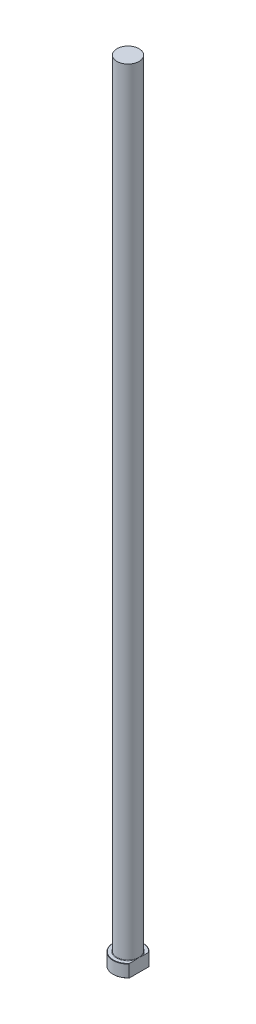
ISO-10303-21;
HEADER;
FILE_DESCRIPTION(('STEP AP214'),'2;1');
FILE_NAME('part.step','',(''),(''),'','','');
FILE_SCHEMA(('AUTOMOTIVE_DESIGN { 1 0 10303 214 1 1 1 1 }'));
ENDSEC;
DATA;
#1=APPLICATION_CONTEXT('core data for automotive mechanical design processes');
#2=APPLICATION_PROTOCOL_DEFINITION('international standard','automotive_design',2000,#1);
#3=PRODUCT_CONTEXT('',#1,'mechanical');
#4=PRODUCT('Part','Part','',(#3));
#5=PRODUCT_RELATED_PRODUCT_CATEGORY('part','',(#4));
#6=PRODUCT_DEFINITION_FORMATION('','',#4);
#7=PRODUCT_DEFINITION_CONTEXT('part definition',#1,'design');
#8=PRODUCT_DEFINITION('design','',#6,#7);
#9=PRODUCT_DEFINITION_SHAPE('','',#8);
#10=(LENGTH_UNIT() NAMED_UNIT(*) SI_UNIT(.MILLI.,.METRE.));
#11=(NAMED_UNIT(*) PLANE_ANGLE_UNIT() SI_UNIT($,.RADIAN.));
#12=(NAMED_UNIT(*) SI_UNIT($,.STERADIAN.) SOLID_ANGLE_UNIT());
#13=UNCERTAINTY_MEASURE_WITH_UNIT(LENGTH_MEASURE(1.E-05),#10,'distance_accuracy_value','');
#14=(GEOMETRIC_REPRESENTATION_CONTEXT(3) GLOBAL_UNCERTAINTY_ASSIGNED_CONTEXT((#13)) GLOBAL_UNIT_ASSIGNED_CONTEXT((#10,
#11,#12)) REPRESENTATION_CONTEXT('',''));
#15=CARTESIAN_POINT('',(0.,0.,0.));
#16=DIRECTION('',(0.,0.,1.));
#17=DIRECTION('',(1.,0.,0.));
#18=AXIS2_PLACEMENT_3D('',#15,#16,#17);
#19=CARTESIAN_POINT('',(0.,0.,0.));
#20=DIRECTION('',(0.,-1.,0.));
#21=DIRECTION('',(0.,0.,-1.));
#22=AXIS2_PLACEMENT_3D('',#19,#20,#21);
#23=PLANE('',#22);
#24=CARTESIAN_POINT('',(0.,0.,0.));
#25=DIRECTION('',(0.,-1.,0.));
#26=DIRECTION('',(0.,0.,-1.));
#27=AXIS2_PLACEMENT_3D('',#24,#25,#26);
#28=CIRCLE('',#27,9.29999999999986);
#29=CARTESIAN_POINT('',(6.99999999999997,0.,6.12290780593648));
#30=VERTEX_POINT('',#29);
#31=CARTESIAN_POINT('',(6.99999999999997,0.,-6.12290780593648));
#32=VERTEX_POINT('',#31);
#33=EDGE_CURVE('E98',#30,#32,#28,.T.);
#34=ORIENTED_EDGE('',*,*,#33,.T.);
#35=DIRECTION('',(0.,0.,1.));
#36=VECTOR('',#35,1.);
#37=CARTESIAN_POINT('',(6.99999999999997,0.,6.42261628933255));
#38=LINE('',#37,#36);
#39=EDGE_CURVE('E83',#32,#30,#38,.T.);
#40=ORIENTED_EDGE('',*,*,#39,.T.);
#41=EDGE_LOOP('',(#34,#40));
#42=FACE_BOUND('',#41,.T.);
#43=ADVANCED_FACE('F32',(#42),#23,.T.);
#44=CARTESIAN_POINT('',(0.,259.958771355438,0.));
#45=DIRECTION('',(0.,1.,0.));
#46=DIRECTION('',(0.,0.,1.));
#47=AXIS2_PLACEMENT_3D('',#44,#45,#46);
#48=CYLINDRICAL_SURFACE('',#47,9.49999999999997);
#49=CARTESIAN_POINT('',(0.,7.79999999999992,0.));
#50=DIRECTION('',(0.,1.,0.));
#51=DIRECTION('',(0.,0.,1.));
#52=AXIS2_PLACEMENT_3D('',#49,#50,#51);
#53=CIRCLE('',#52,9.49999999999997);
#54=CARTESIAN_POINT('',(6.99999999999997,7.79999999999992,6.42261628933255));
#55=VERTEX_POINT('',#54);
#56=CARTESIAN_POINT('',(6.99999999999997,7.79999999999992,-6.42261628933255));
#57=VERTEX_POINT('',#56);
#58=EDGE_CURVE('E104',#55,#57,#53,.F.);
#59=ORIENTED_EDGE('',*,*,#58,.T.);
#60=DIRECTION('',(0.,-1.,0.));
#61=VECTOR('',#60,1.);
#62=CARTESIAN_POINT('',(6.99999999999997,500.,-6.42261628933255));
#63=LINE('',#62,#61);
#64=CARTESIAN_POINT('',(6.99999999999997,0.200000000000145,-6.42261628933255));
#65=VERTEX_POINT('',#64);
#66=EDGE_CURVE('E183',#57,#65,#63,.T.);
#67=ORIENTED_EDGE('',*,*,#66,.T.);
#68=CARTESIAN_POINT('',(0.,0.200000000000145,0.));
#69=DIRECTION('',(0.,-1.,0.));
#70=DIRECTION('',(0.,0.,-1.));
#71=AXIS2_PLACEMENT_3D('',#68,#69,#70);
#72=CIRCLE('',#71,9.49999999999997);
#73=CARTESIAN_POINT('',(6.99999999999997,0.200000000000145,6.42261628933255));
#74=VERTEX_POINT('',#73);
#75=EDGE_CURVE('E100',#65,#74,#72,.F.);
#76=ORIENTED_EDGE('',*,*,#75,.T.);
#77=DIRECTION('',(0.,-1.,0.));
#78=VECTOR('',#77,1.);
#79=CARTESIAN_POINT('',(6.99999999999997,500.,6.42261628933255));
#80=LINE('',#79,#78);
#81=EDGE_CURVE('E93',#55,#74,#80,.T.);
#82=ORIENTED_EDGE('',*,*,#81,.F.);
#83=EDGE_LOOP('',(#59,#67,#76,#82));
#84=FACE_BOUND('',#83,.T.);
#85=ADVANCED_FACE('F158',(#84),#48,.T.);
#86=CARTESIAN_POINT('',(-9.49999999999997,8.,0.));
#87=DIRECTION('',(0.,1.,0.));
#88=DIRECTION('',(0.,0.,1.));
#89=AXIS2_PLACEMENT_3D('',#86,#87,#88);
#90=PLANE('',#89);
#91=CARTESIAN_POINT('',(0.,8.,0.));
#92=DIRECTION('',(0.,1.,0.));
#93=DIRECTION('',(0.,0.,1.));
#94=AXIS2_PLACEMENT_3D('',#91,#92,#93);
#95=CIRCLE('',#94,9.29999999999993);
#96=CARTESIAN_POINT('',(6.99999999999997,8.,-6.12290780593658));
#97=VERTEX_POINT('',#96);
#98=CARTESIAN_POINT('',(6.99999999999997,8.,6.12290780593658));
#99=VERTEX_POINT('',#98);
#100=EDGE_CURVE('E178',#97,#99,#95,.T.);
#101=ORIENTED_EDGE('',*,*,#100,.T.);
#102=DIRECTION('',(0.,0.,-1.));
#103=VECTOR('',#102,1.);
#104=CARTESIAN_POINT('',(6.99999999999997,8.,0.));
#105=LINE('',#104,#103);
#106=CARTESIAN_POINT('',(6.99999999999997,7.99999999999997,2.07123151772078));
#107=VERTEX_POINT('',#106);
#108=EDGE_CURVE('E57',#99,#107,#105,.T.);
#109=ORIENTED_EDGE('',*,*,#108,.T.);
#110=CARTESIAN_POINT('',(0.,8.,0.));
#111=DIRECTION('',(0.,1.,0.));
#112=DIRECTION('',(0.,0.,1.));
#113=AXIS2_PLACEMENT_3D('',#110,#111,#112);
#114=CIRCLE('',#113,7.29999999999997);
#115=CARTESIAN_POINT('',(6.99999999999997,7.99999999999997,-2.07123151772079));
#116=VERTEX_POINT('',#115);
#117=EDGE_CURVE('E107',#107,#116,#114,.F.);
#118=ORIENTED_EDGE('',*,*,#117,.T.);
#119=EDGE_CURVE('E136',#116,#97,#105,.T.);
#120=ORIENTED_EDGE('',*,*,#119,.T.);
#121=EDGE_LOOP('',(#101,#109,#118,#120));
#122=FACE_BOUND('',#121,.T.);
#123=ADVANCED_FACE('F147',(#122),#90,.T.);
#124=CARTESIAN_POINT('',(0.,8.00000000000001,0.));
#125=DIRECTION('',(0.,-1.,0.));
#126=DIRECTION('',(0.,0.,-1.));
#127=AXIS2_PLACEMENT_3D('',#124,#125,#126);
#128=CONICAL_SURFACE('',#127,9.29999999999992,0.785398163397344);
#129=ORIENTED_EDGE('',*,*,#58,.F.);
#130=CARTESIAN_POINT('',(6.99999999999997,1.53034396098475,14.1308899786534));
#131=CARTESIAN_POINT('',(6.99999999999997,1.71491325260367,13.9249118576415));
#132=CARTESIAN_POINT('',(6.99999999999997,1.89904603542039,13.7185428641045));
#133=CARTESIAN_POINT('',(6.99999999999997,2.26631423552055,13.3049153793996));
#134=CARTESIAN_POINT('',(6.99999999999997,2.44944964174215,13.0976568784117));
#135=CARTESIAN_POINT('',(6.99999999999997,2.99728613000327,12.4742569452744));
#136=CARTESIAN_POINT('',(6.99999999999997,3.36029703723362,12.0566251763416));
#137=CARTESIAN_POINT('',(6.99999999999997,4.08427420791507,11.2117507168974));
#138=CARTESIAN_POINT('',(6.99999999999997,4.44517630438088,10.7844529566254));
#139=CARTESIAN_POINT('',(6.99999999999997,5.15874647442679,9.92312721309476));
#140=CARTESIAN_POINT('',(6.99999999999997,5.51141605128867,9.48910048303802));
#141=CARTESIAN_POINT('',(6.99999999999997,6.01896923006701,8.84742631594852));
#142=CARTESIAN_POINT('',(6.99999999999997,6.17837730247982,8.64335665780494));
#143=CARTESIAN_POINT('',(6.99999999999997,6.49424697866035,8.23295235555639));
#144=CARTESIAN_POINT('',(6.99999999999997,6.65070864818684,8.02661776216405));
#145=CARTESIAN_POINT('',(6.99999999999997,6.96020324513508,7.61121519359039));
#146=CARTESIAN_POINT('',(6.99999999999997,7.11323428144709,7.40214580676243));
#147=CARTESIAN_POINT('',(6.99999999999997,7.41505008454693,6.98096124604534));
#148=CARTESIAN_POINT('',(6.99999999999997,7.56383491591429,6.76884611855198));
#149=CARTESIAN_POINT('',(6.99999999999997,7.85590900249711,6.34153997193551));
#150=CARTESIAN_POINT('',(6.99999999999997,7.99920964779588,6.12635676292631));
#151=CARTESIAN_POINT('',(6.99999999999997,8.27948121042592,5.6918651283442));
#152=CARTESIAN_POINT('',(6.99999999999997,8.41645161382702,5.47255636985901));
#153=CARTESIAN_POINT('',(6.99999999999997,8.6823878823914,5.02937768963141));
#154=CARTESIAN_POINT('',(6.99999999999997,8.81136071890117,4.80551197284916));
#155=CARTESIAN_POINT('',(6.99999999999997,9.05940763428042,4.35239125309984));
#156=CARTESIAN_POINT('',(6.99999999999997,9.17848409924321,4.12313756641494));
#157=CARTESIAN_POINT('',(6.99999999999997,9.39643493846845,3.67451702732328));
#158=CARTESIAN_POINT('',(6.99999999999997,9.49613546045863,3.45555446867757));
#159=CARTESIAN_POINT('',(6.99999999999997,9.68216712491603,3.01196059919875));
#160=CARTESIAN_POINT('',(6.99999999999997,9.76849817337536,2.78732924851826));
#161=CARTESIAN_POINT('',(6.99999999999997,9.92440836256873,2.33335788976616));
#162=CARTESIAN_POINT('',(6.99999999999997,9.9940595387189,2.10404294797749));
#163=CARTESIAN_POINT('',(6.99999999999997,10.1138655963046,1.64031733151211));
#164=CARTESIAN_POINT('',(6.99999999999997,10.1640222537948,1.40590712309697));
#165=CARTESIAN_POINT('',(6.99999999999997,10.2425700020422,0.929223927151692));
#166=CARTESIAN_POINT('',(6.99999999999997,10.2705696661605,0.686885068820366));
#167=CARTESIAN_POINT('',(6.99999999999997,10.3013279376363,0.200615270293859));
#168=CARTESIAN_POINT('',(6.99999999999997,10.3040904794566,-0.0433154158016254));
#169=CARTESIAN_POINT('',(6.99999999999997,10.2841568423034,-0.530455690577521));
#170=CARTESIAN_POINT('',(6.99999999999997,10.2614250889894,-0.773663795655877));
#171=CARTESIAN_POINT('',(6.99999999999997,10.1921204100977,-1.25665022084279));
#172=CARTESIAN_POINT('',(6.99999999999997,10.1455404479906,-1.49642750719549));
#173=CARTESIAN_POINT('',(6.99999999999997,10.0179652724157,-2.02711565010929));
#174=CARTESIAN_POINT('',(6.99999999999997,9.9314309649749,-2.31668202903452));
#175=CARTESIAN_POINT('',(6.99999999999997,9.73281879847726,-2.88683940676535));
#176=CARTESIAN_POINT('',(6.99999999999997,9.62072901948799,-3.16742614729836));
#177=CARTESIAN_POINT('',(6.99999999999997,9.37544865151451,-3.72309493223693));
#178=CARTESIAN_POINT('',(6.99999999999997,9.24202353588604,-3.99807219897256));
#179=CARTESIAN_POINT('',(6.99999999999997,9.03043771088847,-4.40442741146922));
#180=CARTESIAN_POINT('',(6.99999999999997,8.9580084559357,-4.53884829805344));
#181=CARTESIAN_POINT('',(6.99999999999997,8.8097915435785,-4.8058270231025));
#182=CARTESIAN_POINT('',(6.99999999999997,8.73400392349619,-4.93838488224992));
#183=CARTESIAN_POINT('',(6.99999999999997,8.53021990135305,-5.28579188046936));
#184=CARTESIAN_POINT('',(6.99999999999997,8.39975871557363,-5.49919471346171));
#185=CARTESIAN_POINT('',(6.99999999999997,8.13248790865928,-5.92200102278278));
#186=CARTESIAN_POINT('',(6.99999999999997,7.9956774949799,-6.13140399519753));
#187=CARTESIAN_POINT('',(6.99999999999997,7.71682831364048,-6.54682288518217));
#188=CARTESIAN_POINT('',(6.99999999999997,7.57478728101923,-6.7528372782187));
#189=CARTESIAN_POINT('',(6.99999999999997,7.28644304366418,-7.16186819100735));
#190=CARTESIAN_POINT('',(6.99999999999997,7.14013962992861,-7.36488456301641));
#191=CARTESIAN_POINT('',(6.99999999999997,6.84361057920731,-7.76884450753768));
#192=CARTESIAN_POINT('',(6.99999999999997,6.69337569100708,-7.96978127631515));
#193=CARTESIAN_POINT('',(6.99999999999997,6.38992067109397,-8.36939053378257));
#194=CARTESIAN_POINT('',(6.99999999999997,6.23670046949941,-8.56806296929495));
#195=CARTESIAN_POINT('',(6.99999999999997,5.77336216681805,-9.16102891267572));
#196=CARTESIAN_POINT('',(6.99999999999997,5.45948252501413,-9.55238415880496));
#197=CARTESIAN_POINT('',(6.99999999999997,4.8492433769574,-10.2987199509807));
#198=CARTESIAN_POINT('',(6.99999999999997,4.5534328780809,-10.6541520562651));
#199=CARTESIAN_POINT('',(6.99999999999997,3.95698657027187,-11.360983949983));
#200=CARTESIAN_POINT('',(6.99999999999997,3.65635041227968,-11.7123834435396));
#201=CARTESIAN_POINT('',(6.99999999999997,3.05314532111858,-12.4098102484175));
#202=CARTESIAN_POINT('',(6.99999999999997,2.75059903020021,-12.7558571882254));
#203=CARTESIAN_POINT('',(6.99999999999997,2.14253477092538,-13.4452477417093));
#204=CARTESIAN_POINT('',(6.99999999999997,1.83701721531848,-13.7885917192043));
#205=CARTESIAN_POINT('',(6.99999999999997,1.53034396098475,-14.1308899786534));
#206=B_SPLINE_CURVE_WITH_KNOTS('',3,(#130,#131,#132,#133,#134,#135,#136,#137,#138,#139,#140,
#141,#142,#143,#144,#145,#146,#147,#148,#149,#150,#151,#152,#153,#154,#155,#156,#157,#158,#159,
#160,#161,#162,#163,#164,#165,#166,#167,#168,#169,#170,#171,#172,#173,#174,#175,#176,#177,#178,
#179,#180,#181,#182,#183,#184,#185,#186,#187,#188,#189,#190,#191,#192,#193,#194,#195,#196,#197,
#198,#199,#200,#201,#202,#203,#204,#205),.UNSPECIFIED.,.F.,.F.,(4,2,2,2,2,2,2,2,2,2,2,2,2,2,2,2,
2,2,2,2,2,2,2,2,2,2,2,2,2,2,2,2,2,2,2,2,2,4),(0.,0.829718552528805,1.65944628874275,
3.3194424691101,4.99732345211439,6.67489561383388,7.45172624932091,8.22853952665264,
9.00577097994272,9.78299060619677,10.5584971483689,11.3340665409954,12.1089500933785,
12.8836462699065,13.6050666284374,14.3264920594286,15.0447432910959,15.7629290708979,
16.4935355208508,17.2240280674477,17.9555412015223,18.6872702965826,19.5923616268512,
20.4978759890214,21.4141315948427,21.8721729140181,22.3302091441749,23.0804263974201,
23.8307375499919,24.5813775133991,25.3320543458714,26.084693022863,26.8373493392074,
28.3422397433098,29.7294652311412,31.1167915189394,32.4957382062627,33.8744959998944),.UNSPECIFIED.);
#207=EDGE_CURVE('E135',#55,#99,#206,.T.);
#208=ORIENTED_EDGE('',*,*,#207,.T.);
#209=ORIENTED_EDGE('',*,*,#100,.F.);
#210=EDGE_CURVE('E127',#97,#57,#206,.T.);
#211=ORIENTED_EDGE('',*,*,#210,.T.);
#212=EDGE_LOOP('',(#129,#208,#209,#211));
#213=FACE_BOUND('',#212,.T.);
#214=ADVANCED_FACE('F143',(#213),#128,.T.);
#215=CARTESIAN_POINT('',(0.,0.200000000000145,0.));
#216=DIRECTION('',(0.,1.,0.));
#217=DIRECTION('',(0.,0.,1.));
#218=AXIS2_PLACEMENT_3D('',#215,#216,#217);
#219=CONICAL_SURFACE('',#218,9.49999999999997,0.785398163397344);
#220=ORIENTED_EDGE('',*,*,#75,.F.);
#221=CARTESIAN_POINT('',(6.99999999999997,6.46965603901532,-14.1308899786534));
#222=CARTESIAN_POINT('',(6.99999999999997,6.28508674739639,-13.9249118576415));
#223=CARTESIAN_POINT('',(6.99999999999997,6.10095396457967,-13.7185428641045));
#224=CARTESIAN_POINT('',(6.99999999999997,5.73368576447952,-13.3049153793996));
#225=CARTESIAN_POINT('',(6.99999999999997,5.55055035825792,-13.0976568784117));
#226=CARTESIAN_POINT('',(6.99999999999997,5.00271386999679,-12.4742569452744));
#227=CARTESIAN_POINT('',(6.99999999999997,4.63970296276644,-12.0566251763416));
#228=CARTESIAN_POINT('',(6.99999999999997,3.91572579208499,-11.2117507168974));
#229=CARTESIAN_POINT('',(6.99999999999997,3.55482369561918,-10.7844529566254));
#230=CARTESIAN_POINT('',(6.99999999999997,2.84125352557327,-9.92312721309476));
#231=CARTESIAN_POINT('',(6.99999999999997,2.4885839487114,-9.48910048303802));
#232=CARTESIAN_POINT('',(6.99999999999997,1.98103076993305,-8.84742631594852));
#233=CARTESIAN_POINT('',(6.99999999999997,1.82162269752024,-8.64335665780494));
#234=CARTESIAN_POINT('',(6.99999999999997,1.50575302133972,-8.23295235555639));
#235=CARTESIAN_POINT('',(6.99999999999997,1.34929135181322,-8.02661776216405));
#236=CARTESIAN_POINT('',(6.99999999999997,1.03979675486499,-7.61121519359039));
#237=CARTESIAN_POINT('',(6.99999999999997,0.886765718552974,-7.40214580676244));
#238=CARTESIAN_POINT('',(6.99999999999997,0.584949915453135,-6.98096124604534));
#239=CARTESIAN_POINT('',(6.99999999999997,0.436165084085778,-6.76884611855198));
#240=CARTESIAN_POINT('',(6.99999999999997,0.144090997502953,-6.34153997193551));
#241=CARTESIAN_POINT('',(6.99999999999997,0.000790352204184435,-6.12635676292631));
#242=CARTESIAN_POINT('',(6.99999999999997,-0.279481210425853,-5.6918651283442));
#243=CARTESIAN_POINT('',(6.99999999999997,-0.416451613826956,-5.47255636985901));
#244=CARTESIAN_POINT('',(6.99999999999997,-0.682387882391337,-5.02937768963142));
#245=CARTESIAN_POINT('',(6.99999999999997,-0.811360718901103,-4.80551197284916));
#246=CARTESIAN_POINT('',(6.99999999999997,-1.05940763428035,-4.35239125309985));
#247=CARTESIAN_POINT('',(6.99999999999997,-1.17848409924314,-4.12313756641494));
#248=CARTESIAN_POINT('',(6.99999999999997,-1.39643493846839,-3.67451702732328));
#249=CARTESIAN_POINT('',(6.99999999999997,-1.49613546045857,-3.45555446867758));
#250=CARTESIAN_POINT('',(6.99999999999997,-1.68216712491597,-3.01196059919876));
#251=CARTESIAN_POINT('',(6.99999999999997,-1.7684981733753,-2.78732924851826));
#252=CARTESIAN_POINT('',(6.99999999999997,-1.92440836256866,-2.33335788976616));
#253=CARTESIAN_POINT('',(6.99999999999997,-1.99405953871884,-2.1040429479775));
#254=CARTESIAN_POINT('',(6.99999999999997,-2.11386559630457,-1.64031733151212));
#255=CARTESIAN_POINT('',(6.99999999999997,-2.16402225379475,-1.40590712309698));
#256=CARTESIAN_POINT('',(6.99999999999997,-2.24257000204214,-0.929223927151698));
#257=CARTESIAN_POINT('',(6.99999999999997,-2.27056966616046,-0.686885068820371));
#258=CARTESIAN_POINT('',(6.99999999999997,-2.30132793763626,-0.200615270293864));
#259=CARTESIAN_POINT('',(6.99999999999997,-2.30409047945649,0.0433154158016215));
#260=CARTESIAN_POINT('',(6.99999999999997,-2.28415684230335,0.530455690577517));
#261=CARTESIAN_POINT('',(6.99999999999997,-2.2614250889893,0.773663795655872));
#262=CARTESIAN_POINT('',(6.99999999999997,-2.19212041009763,1.25665022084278));
#263=CARTESIAN_POINT('',(6.99999999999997,-2.14554044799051,1.49642750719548));
#264=CARTESIAN_POINT('',(6.99999999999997,-2.01796527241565,2.02711565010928));
#265=CARTESIAN_POINT('',(6.99999999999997,-1.93143096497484,2.31668202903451));
#266=CARTESIAN_POINT('',(6.99999999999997,-1.7328187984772,2.88683940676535));
#267=CARTESIAN_POINT('',(6.99999999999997,-1.62072901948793,3.16742614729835));
#268=CARTESIAN_POINT('',(6.99999999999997,-1.37544865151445,3.72309493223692));
#269=CARTESIAN_POINT('',(6.99999999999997,-1.24202353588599,3.99807219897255));
#270=CARTESIAN_POINT('',(6.99999999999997,-1.03043771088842,4.4044274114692));
#271=CARTESIAN_POINT('',(6.99999999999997,-0.958008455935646,4.53884829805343));
#272=CARTESIAN_POINT('',(6.99999999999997,-0.809791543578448,4.80582702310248));
#273=CARTESIAN_POINT('',(6.99999999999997,-0.734003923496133,4.93838488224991));
#274=CARTESIAN_POINT('',(6.99999999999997,-0.530219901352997,5.28579188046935));
#275=CARTESIAN_POINT('',(6.99999999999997,-0.399758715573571,5.4991947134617));
#276=CARTESIAN_POINT('',(6.99999999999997,-0.132487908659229,5.92200102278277));
#277=CARTESIAN_POINT('',(6.99999999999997,0.00432250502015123,6.13140399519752));
#278=CARTESIAN_POINT('',(6.99999999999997,0.283171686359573,6.54682288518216));
#279=CARTESIAN_POINT('',(6.99999999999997,0.425212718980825,6.75283727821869));
#280=CARTESIAN_POINT('',(6.99999999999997,0.713556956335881,7.16186819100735));
#281=CARTESIAN_POINT('',(6.99999999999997,0.859860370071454,7.36488456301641));
#282=CARTESIAN_POINT('',(6.99999999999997,1.15638942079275,7.76884450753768));
#283=CARTESIAN_POINT('',(6.99999999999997,1.30662430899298,7.96978127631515));
#284=CARTESIAN_POINT('',(6.99999999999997,1.61007932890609,8.36939053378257));
#285=CARTESIAN_POINT('',(6.99999999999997,1.76329953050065,8.56806296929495));
#286=CARTESIAN_POINT('',(6.99999999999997,2.22663783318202,9.16102891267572));
#287=CARTESIAN_POINT('',(6.99999999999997,2.54051747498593,9.55238415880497));
#288=CARTESIAN_POINT('',(6.99999999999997,3.15075662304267,10.2987199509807));
#289=CARTESIAN_POINT('',(6.99999999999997,3.44656712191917,10.6541520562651));
#290=CARTESIAN_POINT('',(6.99999999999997,4.0430134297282,11.360983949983));
#291=CARTESIAN_POINT('',(6.99999999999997,4.34364958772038,11.7123834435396));
#292=CARTESIAN_POINT('',(6.99999999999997,4.94685467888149,12.4098102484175));
#293=CARTESIAN_POINT('',(6.99999999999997,5.24940096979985,12.7558571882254));
#294=CARTESIAN_POINT('',(6.99999999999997,5.85746522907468,13.4452477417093));
#295=CARTESIAN_POINT('',(6.99999999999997,6.16298278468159,13.7885917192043));
#296=CARTESIAN_POINT('',(6.99999999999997,6.46965603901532,14.1308899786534));
#297=B_SPLINE_CURVE_WITH_KNOTS('',3,(#221,#222,#223,#224,#225,#226,#227,#228,#229,#230,#231,
#232,#233,#234,#235,#236,#237,#238,#239,#240,#241,#242,#243,#244,#245,#246,#247,#248,#249,#250,
#251,#252,#253,#254,#255,#256,#257,#258,#259,#260,#261,#262,#263,#264,#265,#266,#267,#268,#269,
#270,#271,#272,#273,#274,#275,#276,#277,#278,#279,#280,#281,#282,#283,#284,#285,#286,#287,#288,
#289,#290,#291,#292,#293,#294,#295,#296),.UNSPECIFIED.,.F.,.F.,(4,2,2,2,2,2,2,2,2,2,2,2,2,2,2,2,
2,2,2,2,2,2,2,2,2,2,2,2,2,2,2,2,2,2,2,2,2,4),(0.,0.829718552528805,1.65944628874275,
3.31944246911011,4.99732345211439,6.67489561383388,7.45172624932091,8.22853952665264,
9.00577097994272,9.78299060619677,10.5584971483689,11.3340665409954,12.1089500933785,
12.8836462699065,13.6050666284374,14.3264920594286,15.0447432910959,15.7629290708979,
16.4935355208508,17.2240280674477,17.9555412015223,18.6872702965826,19.5923616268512,
20.4978759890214,21.4141315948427,21.8721729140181,22.3302091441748,23.0804263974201,
23.8307375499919,24.5813775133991,25.3320543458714,26.084693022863,26.8373493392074,
28.3422397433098,29.7294652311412,31.1167915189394,32.4957382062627,33.8744959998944),.UNSPECIFIED.);
#298=EDGE_CURVE('E86',#65,#32,#297,.T.);
#299=ORIENTED_EDGE('',*,*,#298,.T.);
#300=ORIENTED_EDGE('',*,*,#33,.F.);
#301=EDGE_CURVE('E89',#30,#74,#297,.T.);
#302=ORIENTED_EDGE('',*,*,#301,.T.);
#303=EDGE_LOOP('',(#220,#299,#300,#302));
#304=FACE_BOUND('',#303,.T.);
#305=ADVANCED_FACE('F97',(#304),#219,.T.);
#306=CARTESIAN_POINT('',(0.,8.29999999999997,0.));
#307=DIRECTION('',(0.,1.,0.));
#308=DIRECTION('',(0.,0.,1.));
#309=AXIS2_PLACEMENT_3D('',#306,#307,#308);
#310=TOROIDAL_SURFACE('',#309,7.29999999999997,0.3);
#311=CARTESIAN_POINT('',(6.99999999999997,8.29999999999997,0.));
#312=CARTESIAN_POINT('',(6.99999999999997,8.30000062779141,2.32628436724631E-11));
#313=CARTESIAN_POINT('',(6.99999999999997,8.30000125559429,-3.16909151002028E-07));
#314=CARTESIAN_POINT('',(6.99999999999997,8.30000241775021,-1.14637032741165E-06));
#315=CARTESIAN_POINT('',(6.99999999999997,8.30000292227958,-1.68168831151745E-06));
#316=CARTESIAN_POINT('',(6.99999999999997,8.30000400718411,-2.97869773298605E-06));
#317=CARTESIAN_POINT('',(6.99999999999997,8.3000045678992,-3.76131372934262E-06));
#318=CARTESIAN_POINT('',(6.99999999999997,8.30000553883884,-5.35167984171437E-06));
#319=CARTESIAN_POINT('',(6.99999999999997,8.30000595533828,-6.15604641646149E-06));
#320=CARTESIAN_POINT('',(6.99999999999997,8.30000758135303,-9.38802933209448E-06));
#321=CARTESIAN_POINT('',(6.99999999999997,8.30000871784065,-1.18573465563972E-05));
#322=CARTESIAN_POINT('',(6.99999999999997,8.30001050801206,-1.66549716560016E-05));
#323=CARTESIAN_POINT('',(6.99999999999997,8.30001120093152,-1.89691201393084E-05));
#324=CARTESIAN_POINT('',(6.99999999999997,8.30001423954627,-2.90735269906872E-05));
#325=CARTESIAN_POINT('',(6.99999999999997,8.30001661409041,-3.68567172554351E-05));
#326=CARTESIAN_POINT('',(6.99999999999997,8.30001997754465,-5.13387675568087E-05));
#327=CARTESIAN_POINT('',(6.99999999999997,8.30002113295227,-5.79981989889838E-05));
#328=CARTESIAN_POINT('',(6.99999999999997,8.30002974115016,-0.000108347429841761));
#329=CARTESIAN_POINT('',(6.99999999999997,8.30003649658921,-0.000152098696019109));
#330=CARTESIAN_POINT('',(6.99999999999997,8.30006604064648,-0.00032623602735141));
#331=CARTESIAN_POINT('',(6.99999999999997,8.30009398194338,-0.000455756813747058));
#332=CARTESIAN_POINT('',(6.99999999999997,8.30020370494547,-0.000971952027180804));
#333=CARTESIAN_POINT('',(6.99999999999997,8.30028233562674,-0.00135905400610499));
#334=CARTESIAN_POINT('',(6.99999999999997,8.30059908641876,-0.0029081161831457));
#335=CARTESIAN_POINT('',(6.99999999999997,8.30084128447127,-0.00406949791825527));
#336=CARTESIAN_POINT('',(6.99999999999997,8.30185637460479,-0.00894870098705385));
#337=CARTESIAN_POINT('',(6.99999999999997,8.30262406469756,-0.0126672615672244));
#338=CARTESIAN_POINT('',(6.99999999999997,8.30904362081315,-0.0437472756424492));
#339=CARTESIAN_POINT('',(6.99999999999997,8.31471492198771,-0.0711060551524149));
#340=CARTESIAN_POINT('',(6.99999999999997,8.32579896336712,-0.124711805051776));
#341=CARTESIAN_POINT('',(6.99999999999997,8.33121280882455,-0.150958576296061));
#342=CARTESIAN_POINT('',(6.99999999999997,8.34888721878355,-0.236855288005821));
#343=CARTESIAN_POINT('',(6.99999999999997,8.36109504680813,-0.296516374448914));
#344=CARTESIAN_POINT('',(6.99999999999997,8.38163193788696,-0.398125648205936));
#345=CARTESIAN_POINT('',(6.99999999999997,8.39003371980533,-0.440059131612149));
#346=CARTESIAN_POINT('',(6.99999999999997,8.40641913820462,-0.522820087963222));
#347=CARTESIAN_POINT('',(6.99999999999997,8.41440792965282,-0.563646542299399));
#348=CARTESIAN_POINT('',(6.99999999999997,8.44025584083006,-0.69774531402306));
#349=CARTESIAN_POINT('',(6.99999999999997,8.45763052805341,-0.791112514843));
#350=CARTESIAN_POINT('',(6.99999999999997,8.49070400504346,-0.979068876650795));
#351=CARTESIAN_POINT('',(6.99999999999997,8.5063851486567,-1.07366117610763));
#352=CARTESIAN_POINT('',(6.99999999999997,8.53649600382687,-1.27237182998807));
#353=CARTESIAN_POINT('',(6.99999999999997,8.55066037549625,-1.37653153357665));
#354=CARTESIAN_POINT('',(6.99999999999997,8.57450660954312,-1.58508707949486));
#355=CARTESIAN_POINT('',(6.99999999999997,8.58420070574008,-1.68948148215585));
#356=CARTESIAN_POINT('',(6.99999999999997,8.5971656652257,-1.89515538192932));
#357=CARTESIAN_POINT('',(6.99999999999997,8.60064432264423,-1.99641968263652));
#358=CARTESIAN_POINT('',(6.99999999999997,8.59954163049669,-2.14745317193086));
#359=CARTESIAN_POINT('',(6.99999999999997,8.59815772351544,-2.19724153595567));
#360=CARTESIAN_POINT('',(6.99999999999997,8.59283451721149,-2.29666246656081));
#361=CARTESIAN_POINT('',(6.99999999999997,8.58889656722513,-2.34629510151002));
#362=CARTESIAN_POINT('',(6.99999999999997,8.57769755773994,-2.44571674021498));
#363=CARTESIAN_POINT('',(6.99999999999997,8.57040396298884,-2.49550242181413));
#364=CARTESIAN_POINT('',(6.99999999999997,8.5560244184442,-2.56951537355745));
#365=CARTESIAN_POINT('',(6.99999999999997,8.55065780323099,-2.59407625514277));
#366=CARTESIAN_POINT('',(6.99999999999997,8.53852479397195,-2.64284584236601));
#367=CARTESIAN_POINT('',(6.99999999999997,8.53175908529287,-2.66705471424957));
#368=CARTESIAN_POINT('',(6.99999999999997,8.51748926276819,-2.71174649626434));
#369=CARTESIAN_POINT('',(6.99999999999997,8.510201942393,-2.73229789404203));
#370=CARTESIAN_POINT('',(6.99999999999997,8.4939308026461,-2.77282387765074));
#371=CARTESIAN_POINT('',(6.99999999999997,8.4849410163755,-2.79279614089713));
#372=CARTESIAN_POINT('',(6.99999999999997,8.46462265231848,-2.83190553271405));
#373=CARTESIAN_POINT('',(6.99999999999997,8.45326134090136,-2.85102586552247));
#374=CARTESIAN_POINT('',(6.99999999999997,8.4274542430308,-2.88704231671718));
#375=CARTESIAN_POINT('',(6.99999999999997,8.41303489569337,-2.90395561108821));
#376=CARTESIAN_POINT('',(6.99999999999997,8.39049681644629,-2.92384155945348));
#377=CARTESIAN_POINT('',(6.99999999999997,8.3841904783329,-2.92884725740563));
#378=CARTESIAN_POINT('',(6.99999999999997,8.37097183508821,-2.9380049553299));
#379=CARTESIAN_POINT('',(6.99999999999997,8.36405938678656,-2.94215675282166));
#380=CARTESIAN_POINT('',(6.99999999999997,8.34956926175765,-2.94936604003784));
#381=CARTESIAN_POINT('',(6.99999999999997,8.3419846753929,-2.95240998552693));
#382=CARTESIAN_POINT('',(6.99999999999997,8.32637763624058,-2.95700924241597));
#383=CARTESIAN_POINT('',(6.99999999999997,8.31835605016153,-2.95856739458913));
#384=CARTESIAN_POINT('',(6.99999999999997,8.30291040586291,-2.95992508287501));
#385=CARTESIAN_POINT('',(6.99999999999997,8.29549953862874,-2.95987367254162));
#386=CARTESIAN_POINT('',(6.99999999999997,8.28081803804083,-2.95838504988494));
#387=CARTESIAN_POINT('',(6.99999999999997,8.2735474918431,-2.95694700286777));
#388=CARTESIAN_POINT('',(6.99999999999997,8.25853285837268,-2.95260391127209));
#389=CARTESIAN_POINT('',(6.99999999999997,8.25083383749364,-2.94954604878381));
#390=CARTESIAN_POINT('',(6.99999999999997,8.23603628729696,-2.94222418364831));
#391=CARTESIAN_POINT('',(6.99999999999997,8.22893877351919,-2.93795819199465));
#392=CARTESIAN_POINT('',(6.99999999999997,8.21163875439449,-2.92593351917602));
#393=CARTESIAN_POINT('',(6.99999999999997,8.20187862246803,-2.91754511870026));
#394=CARTESIAN_POINT('',(6.99999999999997,8.18370674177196,-2.89942475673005));
#395=CARTESIAN_POINT('',(6.99999999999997,8.17529892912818,-2.88968902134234));
#396=CARTESIAN_POINT('',(6.99999999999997,8.15199560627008,-2.85953893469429));
#397=CARTESIAN_POINT('',(6.99999999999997,8.13869481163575,-2.8379073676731));
#398=CARTESIAN_POINT('',(6.99999999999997,8.11507068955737,-2.79314645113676));
#399=CARTESIAN_POINT('',(6.99999999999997,8.10475206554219,-2.77001480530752));
#400=CARTESIAN_POINT('',(6.99999999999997,8.08155610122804,-2.71087842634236));
#401=CARTESIAN_POINT('',(6.99999999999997,8.07006528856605,-2.67433519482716));
#402=CARTESIAN_POINT('',(6.99999999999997,8.05044959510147,-2.60033159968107));
#403=CARTESIAN_POINT('',(6.99999999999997,8.04233234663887,-2.56286935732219));
#404=CARTESIAN_POINT('',(6.99999999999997,8.02853576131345,-2.48688638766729));
#405=CARTESIAN_POINT('',(6.99999999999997,8.02289758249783,-2.44835831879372));
#406=CARTESIAN_POINT('',(6.99999999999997,8.01369461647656,-2.37112071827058));
#407=CARTESIAN_POINT('',(6.99999999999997,8.01012698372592,-2.3324115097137));
#408=CARTESIAN_POINT('',(6.99999999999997,8.00239886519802,-2.2228003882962));
#409=CARTESIAN_POINT('',(6.99999999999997,8.00019016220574,-2.15176184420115));
#410=CARTESIAN_POINT('',(6.99999999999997,7.99983406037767,-2.00966186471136));
#411=CARTESIAN_POINT('',(6.99999999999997,8.00168936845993,-1.93860044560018));
#412=CARTESIAN_POINT('',(6.99999999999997,8.00854815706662,-1.7963090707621));
#413=CARTESIAN_POINT('',(6.99999999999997,8.0135661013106,-1.72507984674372));
#414=CARTESIAN_POINT('',(6.99999999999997,8.02608998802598,-1.58283666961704));
#415=CARTESIAN_POINT('',(6.99999999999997,8.0335963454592,-1.51182275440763));
#416=CARTESIAN_POINT('',(6.99999999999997,8.05758224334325,-1.31152735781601));
#417=CARTESIAN_POINT('',(6.99999999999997,8.07635481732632,-1.18252326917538));
#418=CARTESIAN_POINT('',(6.99999999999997,8.11790553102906,-0.926646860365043));
#419=CARTESIAN_POINT('',(6.99999999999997,8.14063741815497,-0.799766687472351));
#420=CARTESIAN_POINT('',(6.99999999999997,8.17322033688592,-0.627620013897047));
#421=CARTESIAN_POINT('',(6.99999999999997,8.18199317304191,-0.582145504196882));
#422=CARTESIAN_POINT('',(6.99999999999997,8.20004716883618,-0.489938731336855));
#423=CARTESIAN_POINT('',(6.99999999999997,8.20933569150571,-0.443207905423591));
#424=CARTESIAN_POINT('',(6.99999999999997,8.22546843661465,-0.362914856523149));
#425=CARTESIAN_POINT('',(6.99999999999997,8.23226586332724,-0.329343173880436));
#426=CARTESIAN_POINT('',(6.99999999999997,8.24586025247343,-0.262588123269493));
#427=CARTESIAN_POINT('',(6.99999999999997,8.25265638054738,-0.229404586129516));
#428=CARTESIAN_POINT('',(6.99999999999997,8.26550614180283,-0.166874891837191));
#429=CARTESIAN_POINT('',(6.99999999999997,8.27155497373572,-0.137527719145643));
#430=CARTESIAN_POINT('',(6.99999999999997,8.28394498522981,-0.0775831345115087));
#431=CARTESIAN_POINT('',(6.99999999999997,8.29028759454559,-0.0469859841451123));
#432=CARTESIAN_POINT('',(6.99999999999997,8.29737625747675,-0.0126656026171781));
#433=CARTESIAN_POINT('',(6.99999999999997,8.2981443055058,-0.00894538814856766));
#434=CARTESIAN_POINT('',(6.99999999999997,8.29915947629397,-0.00406582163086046));
#435=CARTESIAN_POINT('',(6.99999999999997,8.29940140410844,-0.00290573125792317));
#436=CARTESIAN_POINT('',(6.99999999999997,8.29971782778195,-0.0013582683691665));
#437=CARTESIAN_POINT('',(6.99999999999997,8.29979639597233,-0.000971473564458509));
#438=CARTESIAN_POINT('',(6.99999999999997,8.29990604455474,-0.00045563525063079));
#439=CARTESIAN_POINT('',(6.99999999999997,8.2999339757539,-0.00032616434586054));
#440=CARTESIAN_POINT('',(6.99999999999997,8.29996351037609,-0.000152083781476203));
#441=CARTESIAN_POINT('',(6.99999999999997,8.29997026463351,-0.000108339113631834));
#442=CARTESIAN_POINT('',(6.99999999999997,8.29997887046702,-5.79966730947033E-05));
#443=CARTESIAN_POINT('',(6.99999999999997,8.29998002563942,-5.13375708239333E-05));
#444=CARTESIAN_POINT('',(6.99999999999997,8.29998338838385,-3.68562290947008E-05));
#445=CARTESIAN_POINT('',(6.99999999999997,8.29998576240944,-2.9073401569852E-05));
#446=CARTESIAN_POINT('',(6.99999999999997,8.29998880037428,-1.89693796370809E-05));
#447=CARTESIAN_POINT('',(6.99999999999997,8.29998949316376,-1.66552553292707E-05));
#448=CARTESIAN_POINT('',(6.99999999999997,8.29999128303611,-1.18576606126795E-05));
#449=CARTESIAN_POINT('',(6.99999999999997,8.29999241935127,-9.38834607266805E-06));
#450=CARTESIAN_POINT('',(6.99999999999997,8.29999404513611,-6.15634604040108E-06));
#451=CARTESIAN_POINT('',(6.99999999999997,8.29999446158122,-5.35196750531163E-06));
#452=CARTESIAN_POINT('',(6.99999999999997,8.29999543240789,-3.76156768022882E-06));
#453=CARTESIAN_POINT('',(6.99999999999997,8.29999599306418,-2.97892936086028E-06));
#454=CARTESIAN_POINT('',(6.99999999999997,8.29999707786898,-1.68186922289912E-06));
#455=CARTESIAN_POINT('',(6.99999999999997,8.29999758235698,-1.14652506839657E-06));
#456=CARTESIAN_POINT('',(6.99999999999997,8.29999874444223,-3.16995288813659E-07));
#457=CARTESIAN_POINT('',(6.99999999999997,8.29999937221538,-2.32625899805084E-11));
#458=CARTESIAN_POINT('',(6.99999999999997,8.29999999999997,0.));
#459=B_SPLINE_CURVE_WITH_KNOTS('',3,(#311,#312,#313,#314,#315,#316,#317,#318,#319,#320,#321,
#322,#323,#324,#325,#326,#327,#328,#329,#330,#331,#332,#333,#334,#335,#336,#337,#338,#339,#340,
#341,#342,#343,#344,#345,#346,#347,#348,#349,#350,#351,#352,#353,#354,#355,#356,#357,#358,#359,
#360,#361,#362,#363,#364,#365,#366,#367,#368,#369,#370,#371,#372,#373,#374,#375,#376,#377,#378,
#379,#380,#381,#382,#383,#384,#385,#386,#387,#388,#389,#390,#391,#392,#393,#394,#395,#396,#397,
#398,#399,#400,#401,#402,#403,#404,#405,#406,#407,#408,#409,#410,#411,#412,#413,#414,#415,#416,
#417,#418,#419,#420,#421,#422,#423,#424,#425,#426,#427,#428,#429,#430,#431,#432,#433,#434,#435,
#436,#437,#438,#439,#440,#441,#442,#443,#444,#445,#446,#447,#448,#449,#450,#451,#452,#453,#454,
#455,#456,#457,#458),.UNSPECIFIED.,.T.,.F.,(4,2,2,2,2,2,2,2,2,2,2,2,2,2,2,2,2,2,2,2,2,2,2,2,2,2,
2,2,2,2,2,2,2,2,2,2,2,2,2,2,2,2,2,2,2,2,2,2,2,2,2,2,2,2,2,2,2,2,2,2,2,2,2,2,2,2,2,2,2,2,2,2,2,
4),(0.,1.92694186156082E-06,4.15426873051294E-06,7.01948430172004E-06,9.73677742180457E-06,
1.7866977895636E-05,2.51070803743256E-05,4.94892162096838E-05,6.97447127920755E-05,
0.000202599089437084,0.000599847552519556,0.00178514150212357,0.00534391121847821,
0.0167352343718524,0.100554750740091,0.180953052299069,0.363644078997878,0.491944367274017,
0.616746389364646,0.901643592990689,1.18926961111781,1.50455392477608,1.81897020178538,
2.12266301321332,2.27203455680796,2.42132724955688,2.57209897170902,2.64748997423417,
2.72284413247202,2.78820867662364,2.85380670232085,2.92037838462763,2.98639639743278,
3.01049823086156,3.03460577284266,3.05899886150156,3.08334521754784,3.10544427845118,
3.12755665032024,3.15227309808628,3.1770304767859,3.2154208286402,3.25392097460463,
3.32967543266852,3.40554872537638,3.52018968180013,3.63508860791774,3.75182904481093,
3.8684086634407,4.08144496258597,4.29462320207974,4.50878351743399,4.72297956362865,
5.1139392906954,5.50060554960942,5.63954426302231,5.78247850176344,5.88523725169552,
5.98685401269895,6.07674665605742,6.17048759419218,6.18188399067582,6.18543880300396,
6.18662315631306,6.18702025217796,6.18715308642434,6.18717334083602,6.18719772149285,
6.18720496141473,6.1872130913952,6.18721580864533,6.1872186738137,6.18722090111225,
6.1872228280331),.UNSPECIFIED.);
#460=CARTESIAN_POINT('',(6.99999999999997,8.29999999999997,0.));
#461=VERTEX_POINT('',#460);
#462=EDGE_CURVE('E11',#116,#461,#459,.T.);
#463=ORIENTED_EDGE('',*,*,#462,.F.);
#464=ORIENTED_EDGE('',*,*,#117,.F.);
#465=CARTESIAN_POINT('',(6.99999999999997,8.29999999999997,0.));
#466=CARTESIAN_POINT('',(6.99999999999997,8.29999937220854,-2.3263445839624E-11));
#467=CARTESIAN_POINT('',(6.99999999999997,8.29999874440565,3.16909150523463E-07));
#468=CARTESIAN_POINT('',(6.99999999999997,8.29999758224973,1.14637032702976E-06));
#469=CARTESIAN_POINT('',(6.99999999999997,8.29999707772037,1.68168831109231E-06));
#470=CARTESIAN_POINT('',(6.99999999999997,8.29999599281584,2.97869773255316E-06));
#471=CARTESIAN_POINT('',(6.99999999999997,8.29999543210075,3.76131372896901E-06));
#472=CARTESIAN_POINT('',(6.99999999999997,8.2999944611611,5.35167984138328E-06));
#473=CARTESIAN_POINT('',(6.99999999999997,8.29999404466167,6.15604641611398E-06));
#474=CARTESIAN_POINT('',(6.99999999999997,8.29999241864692,9.38802933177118E-06));
#475=CARTESIAN_POINT('',(6.99999999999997,8.2999912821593,1.18573465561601E-05));
#476=CARTESIAN_POINT('',(6.99999999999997,8.29998949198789,1.66549716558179E-05));
#477=CARTESIAN_POINT('',(6.99999999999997,8.29998879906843,1.89691201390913E-05));
#478=CARTESIAN_POINT('',(6.99999999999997,8.29998576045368,2.90735269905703E-05));
#479=CARTESIAN_POINT('',(6.99999999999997,8.29998338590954,3.68567172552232E-05));
#480=CARTESIAN_POINT('',(6.99999999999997,8.2999800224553,5.13387675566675E-05));
#481=CARTESIAN_POINT('',(6.99999999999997,8.29997886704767,5.79981989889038E-05));
#482=CARTESIAN_POINT('',(6.99999999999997,8.29997025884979,0.00010834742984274));
#483=CARTESIAN_POINT('',(6.99999999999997,8.29996350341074,0.00015209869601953));
#484=CARTESIAN_POINT('',(6.99999999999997,8.29993395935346,0.00032623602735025));
#485=CARTESIAN_POINT('',(6.99999999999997,8.29990601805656,0.000455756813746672));
#486=CARTESIAN_POINT('',(6.99999999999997,8.29979629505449,0.000971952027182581));
#487=CARTESIAN_POINT('',(6.99999999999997,8.29971766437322,0.0013590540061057));
#488=CARTESIAN_POINT('',(6.99999999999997,8.29940091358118,0.00290811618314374));
#489=CARTESIAN_POINT('',(6.99999999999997,8.29915871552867,0.00406949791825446));
#490=CARTESIAN_POINT('',(6.99999999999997,8.29814362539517,0.00894870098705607));
#491=CARTESIAN_POINT('',(6.99999999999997,8.29737593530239,0.0126672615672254));
#492=CARTESIAN_POINT('',(6.99999999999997,8.29095637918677,0.0437472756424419));
#493=CARTESIAN_POINT('',(6.99999999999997,8.28528507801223,0.0711060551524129));
#494=CARTESIAN_POINT('',(6.99999999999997,8.27420103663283,0.124711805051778));
#495=CARTESIAN_POINT('',(6.99999999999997,8.2687871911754,0.150958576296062));
#496=CARTESIAN_POINT('',(6.99999999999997,8.25111278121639,0.236855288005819));
#497=CARTESIAN_POINT('',(6.99999999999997,8.23890495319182,0.296516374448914));
#498=CARTESIAN_POINT('',(6.99999999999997,8.21836806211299,0.398125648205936));
#499=CARTESIAN_POINT('',(6.99999999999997,8.20996628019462,0.44005913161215));
#500=CARTESIAN_POINT('',(6.99999999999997,8.19358086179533,0.522820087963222));
#501=CARTESIAN_POINT('',(6.99999999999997,8.18559207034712,0.563646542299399));
#502=CARTESIAN_POINT('',(6.99999999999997,8.15974415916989,0.697745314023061));
#503=CARTESIAN_POINT('',(6.99999999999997,8.14236947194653,0.791112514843));
#504=CARTESIAN_POINT('',(6.99999999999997,8.10929599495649,0.979068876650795));
#505=CARTESIAN_POINT('',(6.99999999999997,8.09361485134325,1.07366117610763));
#506=CARTESIAN_POINT('',(6.99999999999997,8.06350399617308,1.27237182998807));
#507=CARTESIAN_POINT('',(6.99999999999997,8.04933962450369,1.37653153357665));
#508=CARTESIAN_POINT('',(6.99999999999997,8.02549339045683,1.58508707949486));
#509=CARTESIAN_POINT('',(6.99999999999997,8.01579929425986,1.68948148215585));
#510=CARTESIAN_POINT('',(6.99999999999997,8.00283433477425,1.89515538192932));
#511=CARTESIAN_POINT('',(6.99999999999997,7.99935567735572,1.99641968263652));
#512=CARTESIAN_POINT('',(6.99999999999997,8.00045836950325,2.14745317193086));
#513=CARTESIAN_POINT('',(6.99999999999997,8.0018422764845,2.19724153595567));
#514=CARTESIAN_POINT('',(6.99999999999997,8.00716548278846,2.29666246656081));
#515=CARTESIAN_POINT('',(6.99999999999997,8.01110343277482,2.34629510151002));
#516=CARTESIAN_POINT('',(6.99999999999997,8.02230244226,2.44571674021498));
#517=CARTESIAN_POINT('',(6.99999999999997,8.02959603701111,2.49550242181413));
#518=CARTESIAN_POINT('',(6.99999999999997,8.04397558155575,2.56951537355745));
#519=CARTESIAN_POINT('',(6.99999999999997,8.04934219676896,2.59407625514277));
#520=CARTESIAN_POINT('',(6.99999999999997,8.06147520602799,2.64284584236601));
#521=CARTESIAN_POINT('',(6.99999999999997,8.06824091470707,2.66705471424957));
#522=CARTESIAN_POINT('',(6.99999999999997,8.08251073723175,2.71174649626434));
#523=CARTESIAN_POINT('',(6.99999999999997,8.08979805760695,2.73229789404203));
#524=CARTESIAN_POINT('',(6.99999999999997,8.10606919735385,2.77282387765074));
#525=CARTESIAN_POINT('',(6.99999999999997,8.11505898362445,2.79279614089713));
#526=CARTESIAN_POINT('',(6.99999999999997,8.13537734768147,2.83190553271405));
#527=CARTESIAN_POINT('',(6.99999999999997,8.14673865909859,2.85102586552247));
#528=CARTESIAN_POINT('',(6.99999999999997,8.17254575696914,2.88704231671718));
#529=CARTESIAN_POINT('',(6.99999999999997,8.18696510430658,2.90395561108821));
#530=CARTESIAN_POINT('',(6.99999999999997,8.20950318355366,2.92384155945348));
#531=CARTESIAN_POINT('',(6.99999999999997,8.21580952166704,2.92884725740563));
#532=CARTESIAN_POINT('',(6.99999999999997,8.22902816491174,2.9380049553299));
#533=CARTESIAN_POINT('',(6.99999999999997,8.23594061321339,2.94215675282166));
#534=CARTESIAN_POINT('',(6.99999999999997,8.2504307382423,2.94936604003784));
#535=CARTESIAN_POINT('',(6.99999999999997,8.25801532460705,2.95240998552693));
#536=CARTESIAN_POINT('',(6.99999999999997,8.27362236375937,2.95700924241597));
#537=CARTESIAN_POINT('',(6.99999999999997,8.28164394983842,2.95856739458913));
#538=CARTESIAN_POINT('',(6.99999999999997,8.29708959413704,2.95992508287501));
#539=CARTESIAN_POINT('',(6.99999999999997,8.30450046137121,2.95987367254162));
#540=CARTESIAN_POINT('',(6.99999999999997,8.31918196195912,2.95838504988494));
#541=CARTESIAN_POINT('',(6.99999999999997,8.32645250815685,2.95694700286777));
#542=CARTESIAN_POINT('',(6.99999999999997,8.34146714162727,2.95260391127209));
#543=CARTESIAN_POINT('',(6.99999999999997,8.3491661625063,2.94954604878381));
#544=CARTESIAN_POINT('',(6.99999999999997,8.36396371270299,2.94222418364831));
#545=CARTESIAN_POINT('',(6.99999999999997,8.37106122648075,2.93795819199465));
#546=CARTESIAN_POINT('',(6.99999999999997,8.38836124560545,2.92593351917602));
#547=CARTESIAN_POINT('',(6.99999999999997,8.39812137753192,2.91754511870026));
#548=CARTESIAN_POINT('',(6.99999999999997,8.41629325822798,2.89942475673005));
#549=CARTESIAN_POINT('',(6.99999999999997,8.42470107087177,2.88968902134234));
#550=CARTESIAN_POINT('',(6.99999999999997,8.44800439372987,2.85953893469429));
#551=CARTESIAN_POINT('',(6.99999999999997,8.4613051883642,2.8379073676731));
#552=CARTESIAN_POINT('',(6.99999999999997,8.48492931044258,2.79314645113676));
#553=CARTESIAN_POINT('',(6.99999999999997,8.49524793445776,2.77001480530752));
#554=CARTESIAN_POINT('',(6.99999999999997,8.5184438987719,2.71087842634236));
#555=CARTESIAN_POINT('',(6.99999999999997,8.5299347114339,2.67433519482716));
#556=CARTESIAN_POINT('',(6.99999999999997,8.54955040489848,2.60033159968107));
#557=CARTESIAN_POINT('',(6.99999999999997,8.55766765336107,2.56286935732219));
#558=CARTESIAN_POINT('',(6.99999999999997,8.5714642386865,2.48688638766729));
#559=CARTESIAN_POINT('',(6.99999999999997,8.57710241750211,2.44835831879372));
#560=CARTESIAN_POINT('',(6.99999999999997,8.58630538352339,2.37112071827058));
#561=CARTESIAN_POINT('',(6.99999999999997,8.58987301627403,2.3324115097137));
#562=CARTESIAN_POINT('',(6.99999999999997,8.59760113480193,2.2228003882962));
#563=CARTESIAN_POINT('',(6.99999999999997,8.59980983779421,2.15176184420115));
#564=CARTESIAN_POINT('',(6.99999999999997,8.60016593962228,2.00966186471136));
#565=CARTESIAN_POINT('',(6.99999999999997,8.59831063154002,1.93860044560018));
#566=CARTESIAN_POINT('',(6.99999999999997,8.59145184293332,1.79630907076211));
#567=CARTESIAN_POINT('',(6.99999999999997,8.58643389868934,1.72507984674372));
#568=CARTESIAN_POINT('',(6.99999999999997,8.57391001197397,1.58283666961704));
#569=CARTESIAN_POINT('',(6.99999999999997,8.56640365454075,1.51182275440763));
#570=CARTESIAN_POINT('',(6.99999999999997,8.5424177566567,1.31152735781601));
#571=CARTESIAN_POINT('',(6.99999999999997,8.52364518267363,1.18252326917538));
#572=CARTESIAN_POINT('',(6.99999999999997,8.48209446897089,0.926646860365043));
#573=CARTESIAN_POINT('',(6.99999999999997,8.45936258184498,0.799766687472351));
#574=CARTESIAN_POINT('',(6.99999999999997,8.42677966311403,0.627620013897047));
#575=CARTESIAN_POINT('',(6.99999999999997,8.41800682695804,0.582145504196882));
#576=CARTESIAN_POINT('',(6.99999999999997,8.39995283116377,0.489938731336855));
#577=CARTESIAN_POINT('',(6.99999999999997,8.39066430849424,0.443207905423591));
#578=CARTESIAN_POINT('',(6.99999999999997,8.3745315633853,0.362914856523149));
#579=CARTESIAN_POINT('',(6.99999999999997,8.3677341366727,0.329343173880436));
#580=CARTESIAN_POINT('',(6.99999999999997,8.35413974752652,0.262588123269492));
#581=CARTESIAN_POINT('',(6.99999999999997,8.34734361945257,0.229404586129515));
#582=CARTESIAN_POINT('',(6.99999999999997,8.33449385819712,0.166874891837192));
#583=CARTESIAN_POINT('',(6.99999999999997,8.32844502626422,0.137527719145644));
#584=CARTESIAN_POINT('',(6.99999999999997,8.31605501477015,0.0775831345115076));
#585=CARTESIAN_POINT('',(6.99999999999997,8.30971240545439,0.0469859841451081));
#586=CARTESIAN_POINT('',(6.99999999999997,8.3026237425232,0.0126656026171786));
#587=CARTESIAN_POINT('',(6.99999999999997,8.30185569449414,0.00894538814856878));
#588=CARTESIAN_POINT('',(6.99999999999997,8.30084052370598,0.00406582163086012));
#589=CARTESIAN_POINT('',(6.99999999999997,8.30059859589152,0.0029057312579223));
#590=CARTESIAN_POINT('',(6.99999999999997,8.30028217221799,0.00135826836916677));
#591=CARTESIAN_POINT('',(6.99999999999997,8.30020360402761,0.0009714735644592));
#592=CARTESIAN_POINT('',(6.99999999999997,8.30009395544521,0.000455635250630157));
#593=CARTESIAN_POINT('',(6.99999999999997,8.30006602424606,0.000326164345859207));
#594=CARTESIAN_POINT('',(6.99999999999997,8.30003648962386,0.000152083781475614));
#595=CARTESIAN_POINT('',(6.99999999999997,8.30002973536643,0.000108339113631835));
#596=CARTESIAN_POINT('',(6.99999999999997,8.30002112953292,5.79966730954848E-05));
#597=CARTESIAN_POINT('',(6.99999999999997,8.30001997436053,5.13375708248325E-05));
#598=CARTESIAN_POINT('',(6.99999999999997,8.30001661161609,3.6856229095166E-05));
#599=CARTESIAN_POINT('',(6.99999999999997,8.3000142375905,2.90734015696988E-05));
#600=CARTESIAN_POINT('',(6.99999999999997,8.30001119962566,1.89693796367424E-05));
#601=CARTESIAN_POINT('',(6.99999999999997,8.30001050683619,1.66552553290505E-05));
#602=CARTESIAN_POINT('',(6.99999999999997,8.30000871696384,1.18576606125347E-05));
#603=CARTESIAN_POINT('',(6.99999999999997,8.30000758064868,9.38834607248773E-06));
#604=CARTESIAN_POINT('',(6.99999999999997,8.30000595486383,6.15634603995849E-06));
#605=CARTESIAN_POINT('',(6.99999999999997,8.30000553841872,5.3519675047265E-06));
#606=CARTESIAN_POINT('',(6.99999999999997,8.30000456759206,3.76156767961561E-06));
#607=CARTESIAN_POINT('',(6.99999999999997,8.30000400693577,2.97892936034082E-06));
#608=CARTESIAN_POINT('',(6.99999999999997,8.30000292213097,1.6818692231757E-06));
#609=CARTESIAN_POINT('',(6.99999999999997,8.30000241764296,1.1465250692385E-06));
#610=CARTESIAN_POINT('',(6.99999999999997,8.30000125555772,3.16995289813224E-07));
#611=CARTESIAN_POINT('',(6.99999999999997,8.30000062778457,2.32631921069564E-11));
#612=CARTESIAN_POINT('',(6.99999999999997,8.29999999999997,0.));
#613=B_SPLINE_CURVE_WITH_KNOTS('',3,(#465,#466,#467,#468,#469,#470,#471,#472,#473,#474,#475,
#476,#477,#478,#479,#480,#481,#482,#483,#484,#485,#486,#487,#488,#489,#490,#491,#492,#493,#494,
#495,#496,#497,#498,#499,#500,#501,#502,#503,#504,#505,#506,#507,#508,#509,#510,#511,#512,#513,
#514,#515,#516,#517,#518,#519,#520,#521,#522,#523,#524,#525,#526,#527,#528,#529,#530,#531,#532,
#533,#534,#535,#536,#537,#538,#539,#540,#541,#542,#543,#544,#545,#546,#547,#548,#549,#550,#551,
#552,#553,#554,#555,#556,#557,#558,#559,#560,#561,#562,#563,#564,#565,#566,#567,#568,#569,#570,
#571,#572,#573,#574,#575,#576,#577,#578,#579,#580,#581,#582,#583,#584,#585,#586,#587,#588,#589,
#590,#591,#592,#593,#594,#595,#596,#597,#598,#599,#600,#601,#602,#603,#604,#605,#606,#607,#608,
#609,#610,#611,#612),.UNSPECIFIED.,.T.,.F.,(4,2,2,2,2,2,2,2,2,2,2,2,2,2,2,2,2,2,2,2,2,2,2,2,2,2,
2,2,2,2,2,2,2,2,2,2,2,2,2,2,2,2,2,2,2,2,2,2,2,2,2,2,2,2,2,2,2,2,2,2,2,2,2,2,2,2,2,2,2,2,2,2,2,
4),(0.,1.92694186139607E-06,4.15426873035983E-06,7.01948430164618E-06,9.7367774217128E-06,
1.78669778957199E-05,2.51070803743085E-05,4.94892162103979E-05,6.97447127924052E-05,
0.000202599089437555,0.000599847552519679,0.00178514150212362,0.0053439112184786,
0.0167352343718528,0.100554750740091,0.18095305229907,0.363644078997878,0.491944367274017,
0.616746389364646,0.901643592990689,1.18926961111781,1.50455392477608,1.81897020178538,
2.12266301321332,2.27203455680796,2.42132724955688,2.57209897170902,2.64748997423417,
2.72284413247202,2.78820867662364,2.85380670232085,2.92037838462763,2.98639639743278,
3.01049823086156,3.03460577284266,3.05899886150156,3.08334521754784,3.10544427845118,
3.12755665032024,3.15227309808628,3.1770304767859,3.2154208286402,3.25392097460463,
3.32967543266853,3.40554872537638,3.52018968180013,3.63508860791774,3.75182904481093,
3.8684086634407,4.08144496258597,4.29462320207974,4.50878351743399,4.72297956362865,
5.1139392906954,5.50060554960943,5.63954426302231,5.78247850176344,5.88523725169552,
5.98685401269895,6.07674665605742,6.17048759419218,6.18188399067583,6.18543880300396,
6.18662315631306,6.18702025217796,6.18715308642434,6.18717334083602,6.18719772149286,
6.18720496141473,6.1872130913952,6.18721580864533,6.1872186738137,6.18722090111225,
6.1872228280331),.UNSPECIFIED.);
#614=EDGE_CURVE('E46',#461,#107,#613,.T.);
#615=ORIENTED_EDGE('',*,*,#614,.F.);
#616=CARTESIAN_POINT('',(0.,8.29999999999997,0.));
#617=DIRECTION('',(0.,1.,0.));
#618=DIRECTION('',(0.,0.,1.));
#619=AXIS2_PLACEMENT_3D('',#616,#617,#618);
#620=CIRCLE('',#619,6.99999999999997);
#621=EDGE_CURVE('E103',#461,#461,#620,.T.);
#622=ORIENTED_EDGE('',*,*,#621,.F.);
#623=EDGE_LOOP('',(#463,#464,#615,#622));
#624=FACE_BOUND('',#623,.T.);
#625=ADVANCED_FACE('F34',(#624),#310,.F.);
#626=CARTESIAN_POINT('',(0.,259.958771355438,0.));
#627=DIRECTION('',(0.,1.,0.));
#628=DIRECTION('',(0.,0.,1.));
#629=AXIS2_PLACEMENT_3D('',#626,#627,#628);
#630=CYLINDRICAL_SURFACE('',#629,6.99999999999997);
#631=ORIENTED_EDGE('',*,*,#621,.T.);
#632=EDGE_LOOP('',(#631));
#633=FACE_BOUND('',#632,.T.);
#634=CARTESIAN_POINT('',(0.,500.,0.));
#635=DIRECTION('',(0.,1.,0.));
#636=DIRECTION('',(0.,0.,1.));
#637=AXIS2_PLACEMENT_3D('',#634,#635,#636);
#638=CIRCLE('',#637,6.99999999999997);
#639=CARTESIAN_POINT('',(0.,500.,6.99999999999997));
#640=VERTEX_POINT('',#639);
#641=EDGE_CURVE('E101',#640,#640,#638,.T.);
#642=ORIENTED_EDGE('',*,*,#641,.F.);
#643=EDGE_LOOP('',(#642));
#644=FACE_BOUND('',#643,.T.);
#645=ADVANCED_FACE('F155',(#633,#644),#630,.T.);
#646=CARTESIAN_POINT('',(-6.99999999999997,500.,0.));
#647=DIRECTION('',(0.,1.,0.));
#648=DIRECTION('',(0.,0.,1.));
#649=AXIS2_PLACEMENT_3D('',#646,#647,#648);
#650=PLANE('',#649);
#651=ORIENTED_EDGE('',*,*,#641,.T.);
#652=EDGE_LOOP('',(#651));
#653=FACE_BOUND('',#652,.T.);
#654=ADVANCED_FACE('F121',(#653),#650,.T.);
#655=CARTESIAN_POINT('',(6.99999999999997,500.,6.42261628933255));
#656=DIRECTION('',(1.,0.,0.));
#657=DIRECTION('',(0.,0.,-1.));
#658=AXIS2_PLACEMENT_3D('',#655,#656,#657);
#659=PLANE('',#658);
#660=ORIENTED_EDGE('',*,*,#66,.F.);
#661=ORIENTED_EDGE('',*,*,#210,.F.);
#662=ORIENTED_EDGE('',*,*,#119,.F.);
#663=ORIENTED_EDGE('',*,*,#462,.T.);
#664=ORIENTED_EDGE('',*,*,#614,.T.);
#665=ORIENTED_EDGE('',*,*,#108,.F.);
#666=ORIENTED_EDGE('',*,*,#207,.F.);
#667=ORIENTED_EDGE('',*,*,#81,.T.);
#668=ORIENTED_EDGE('',*,*,#301,.F.);
#669=ORIENTED_EDGE('',*,*,#39,.F.);
#670=ORIENTED_EDGE('',*,*,#298,.F.);
#671=EDGE_LOOP('',(#660,#661,#662,#663,#664,#665,#666,#667,#668,#669,#670));
#672=FACE_BOUND('',#671,.T.);
#673=ADVANCED_FACE('F85',(#672),#659,.T.);
#674=CLOSED_SHELL('',(#43,#85,#123,#214,#305,#625,#645,#654,#673));
#675=MANIFOLD_SOLID_BREP('B2',#674);
#676=ADVANCED_BREP_SHAPE_REPRESENTATION('',(#18,#675),#14);
#677=SHAPE_DEFINITION_REPRESENTATION(#9,#676);
ENDSEC;
END-ISO-10303-21;
